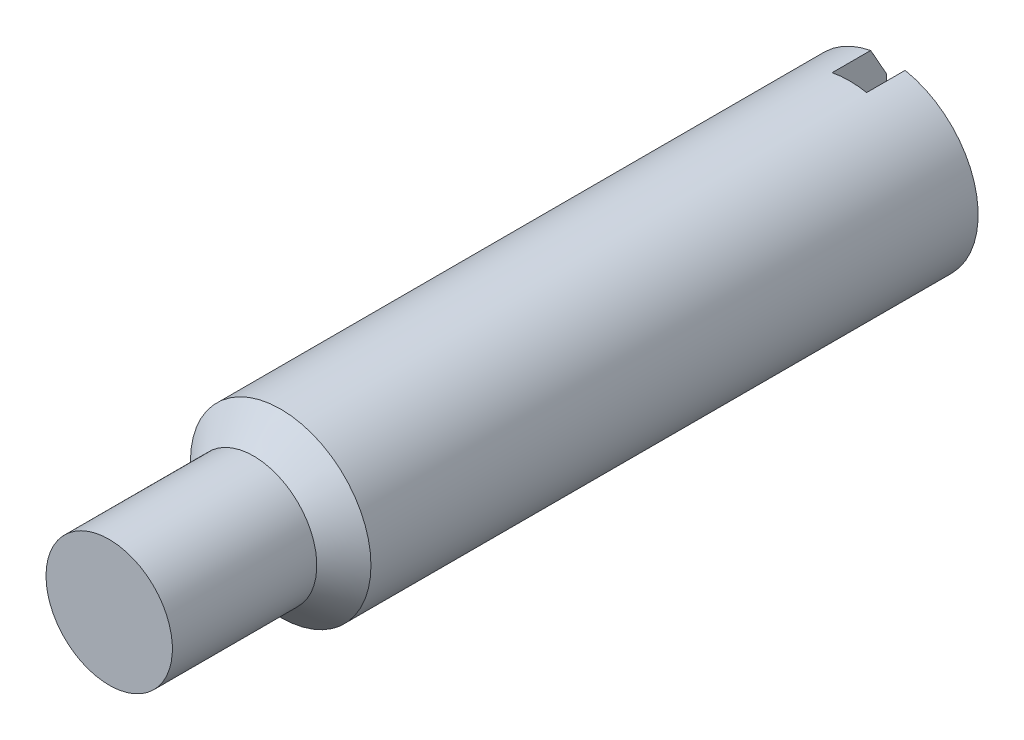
ISO-10303-21;
HEADER;
FILE_DESCRIPTION(('STEP AP214'),'2;1');
FILE_NAME('part.step','',(''),(''),'','','');
FILE_SCHEMA(('AUTOMOTIVE_DESIGN { 1 0 10303 214 1 1 1 1 }'));
ENDSEC;
DATA;
#1=APPLICATION_CONTEXT('core data for automotive mechanical design processes');
#2=APPLICATION_PROTOCOL_DEFINITION('international standard','automotive_design',2000,#1);
#3=PRODUCT_CONTEXT('',#1,'mechanical');
#4=PRODUCT('Part','Part','',(#3));
#5=PRODUCT_RELATED_PRODUCT_CATEGORY('part','',(#4));
#6=PRODUCT_DEFINITION_FORMATION('','',#4);
#7=PRODUCT_DEFINITION_CONTEXT('part definition',#1,'design');
#8=PRODUCT_DEFINITION('design','',#6,#7);
#9=PRODUCT_DEFINITION_SHAPE('','',#8);
#10=(LENGTH_UNIT() NAMED_UNIT(*) SI_UNIT(.MILLI.,.METRE.));
#11=(NAMED_UNIT(*) PLANE_ANGLE_UNIT() SI_UNIT($,.RADIAN.));
#12=(NAMED_UNIT(*) SI_UNIT($,.STERADIAN.) SOLID_ANGLE_UNIT());
#13=UNCERTAINTY_MEASURE_WITH_UNIT(LENGTH_MEASURE(1.E-05),#10,'distance_accuracy_value','');
#14=(GEOMETRIC_REPRESENTATION_CONTEXT(3) GLOBAL_UNCERTAINTY_ASSIGNED_CONTEXT((#13)) GLOBAL_UNIT_ASSIGNED_CONTEXT((#10,
#11,#12)) REPRESENTATION_CONTEXT('',''));
#15=CARTESIAN_POINT('',(0.,0.,0.));
#16=DIRECTION('',(0.,0.,1.));
#17=DIRECTION('',(1.,0.,0.));
#18=AXIS2_PLACEMENT_3D('',#15,#16,#17);
#19=CARTESIAN_POINT('',(0.,0.,0.));
#20=DIRECTION('',(0.,0.,-1.));
#21=DIRECTION('',(-1.,0.,0.));
#22=AXIS2_PLACEMENT_3D('',#19,#20,#21);
#23=PLANE('',#22);
#24=CARTESIAN_POINT('',(0.,0.,0.));
#25=DIRECTION('',(0.,0.,-1.));
#26=DIRECTION('',(-1.,0.,0.));
#27=AXIS2_PLACEMENT_3D('',#24,#25,#26);
#28=CIRCLE('',#27,3.5);
#29=CARTESIAN_POINT('',(0.954999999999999,3.36719096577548,0.));
#30=VERTEX_POINT('',#29);
#31=CARTESIAN_POINT('',(0.954999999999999,-3.36719096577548,0.));
#32=VERTEX_POINT('',#31);
#33=EDGE_CURVE('E164',#30,#32,#28,.T.);
#34=ORIENTED_EDGE('',*,*,#33,.T.);
#35=DIRECTION('',(0.,1.,0.));
#36=VECTOR('',#35,1.);
#37=CARTESIAN_POINT('',(0.954999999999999,-5.00000000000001,0.));
#38=LINE('',#37,#36);
#39=EDGE_CURVE('E105',#32,#30,#38,.T.);
#40=ORIENTED_EDGE('',*,*,#39,.T.);
#41=EDGE_LOOP('',(#34,#40));
#42=FACE_BOUND('',#41,.T.);
#43=ADVANCED_FACE('F33',(#42),#23,.T.);
#44=CARTESIAN_POINT('',(0.,0.,0.));
#45=DIRECTION('',(0.,0.,1.));
#46=DIRECTION('',(1.,0.,0.));
#47=AXIS2_PLACEMENT_3D('',#44,#45,#46);
#48=CONICAL_SURFACE('',#47,3.5,1.0471975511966);
#49=CARTESIAN_POINT('',(0.,0.,0.866025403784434));
#50=DIRECTION('',(0.,0.,-1.));
#51=DIRECTION('',(-1.,0.,0.));
#52=AXIS2_PLACEMENT_3D('',#49,#50,#51);
#53=CIRCLE('',#52,5.);
#54=CARTESIAN_POINT('',(0.955000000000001,4.90795018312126,0.866025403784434));
#55=VERTEX_POINT('',#54);
#56=CARTESIAN_POINT('',(0.955000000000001,-4.90795018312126,0.866025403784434));
#57=VERTEX_POINT('',#56);
#58=EDGE_CURVE('E169',#55,#57,#53,.T.);
#59=ORIENTED_EDGE('',*,*,#58,.T.);
#60=CARTESIAN_POINT('',(0.954999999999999,-11.0226579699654,4.36704919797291));
#61=CARTESIAN_POINT('',(0.954999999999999,-10.5566262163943,4.0990077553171));
#62=CARTESIAN_POINT('',(0.954999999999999,-10.0905538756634,3.83103660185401));
#63=CARTESIAN_POINT('',(0.954999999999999,-9.15823674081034,3.29538269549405));
#64=CARTESIAN_POINT('',(0.954999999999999,-8.69199194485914,3.02769994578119));
#65=CARTESIAN_POINT('',(0.954999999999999,-7.75819630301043,2.49217293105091));
#66=CARTESIAN_POINT('',(0.954999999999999,-7.29064488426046,2.22432966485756));
#67=CARTESIAN_POINT('',(0.954999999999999,-6.35511325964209,1.68940156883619));
#68=CARTESIAN_POINT('',(0.954999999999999,-5.88713305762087,1.42231673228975));
#69=CARTESIAN_POINT('',(0.954999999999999,-5.18597187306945,1.02365418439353));
#70=CARTESIAN_POINT('',(0.954999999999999,-4.9531155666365,0.891505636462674));
#71=CARTESIAN_POINT('',(0.954999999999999,-4.48707515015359,0.6277768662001));
#72=CARTESIAN_POINT('',(0.954999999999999,-4.25389103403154,0.496196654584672));
#73=CARTESIAN_POINT('',(0.954999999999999,-3.78731745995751,0.234113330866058));
#74=CARTESIAN_POINT('',(0.954999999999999,-3.55392866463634,0.103609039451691));
#75=CARTESIAN_POINT('',(0.954999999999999,-3.0863136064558,-0.155870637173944));
#76=CARTESIAN_POINT('',(0.955,-2.85208738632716,-0.284846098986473));
#77=CARTESIAN_POINT('',(0.955,-2.49827785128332,-0.476726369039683));
#78=CARTESIAN_POINT('',(0.955,-2.37930371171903,-0.54075173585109));
#79=CARTESIAN_POINT('',(0.955,-2.14071828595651,-0.667639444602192));
#80=CARTESIAN_POINT('',(0.955,-2.02110692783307,-0.730501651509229));
#81=CARTESIAN_POINT('',(0.955,-1.78055111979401,-0.85461803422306));
#82=CARTESIAN_POINT('',(0.955,-1.65960360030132,-0.915866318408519));
#83=CARTESIAN_POINT('',(0.955,-1.47704471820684,-1.00539757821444));
#84=CARTESIAN_POINT('',(0.955,-1.41600763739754,-1.03484862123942));
#85=CARTESIAN_POINT('',(0.955,-1.29343480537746,-1.09269118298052));
#86=CARTESIAN_POINT('',(0.955,-1.23189907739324,-1.12108275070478));
#87=CARTESIAN_POINT('',(0.955,-1.10456041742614,-1.17803952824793));
#88=CARTESIAN_POINT('',(0.955,-1.03871834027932,-1.2065178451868));
#89=CARTESIAN_POINT('',(0.955,-0.906084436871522,-1.26115325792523));
#90=CARTESIAN_POINT('',(0.955,-0.839292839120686,-1.28731090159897));
#91=CARTESIAN_POINT('',(0.955,-0.704788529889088,-1.33612743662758));
#92=CARTESIAN_POINT('',(0.955,-0.637081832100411,-1.35880263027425));
#93=CARTESIAN_POINT('',(0.955,-0.500197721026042,-1.39922872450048));
#94=CARTESIAN_POINT('',(0.955,-0.43102112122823,-1.41698227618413));
#95=CARTESIAN_POINT('',(0.955,-0.309028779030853,-1.44188890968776));
#96=CARTESIAN_POINT('',(0.955,-0.256535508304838,-1.45059038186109));
#97=CARTESIAN_POINT('',(0.955,-0.150986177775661,-1.46330161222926));
#98=CARTESIAN_POINT('',(0.955,-0.0979303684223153,-1.46731337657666));
#99=CARTESIAN_POINT('',(0.955,0.00823860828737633,-1.47018431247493));
#100=CARTESIAN_POINT('',(0.955,0.0613515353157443,-1.46905200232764));
#101=CARTESIAN_POINT('',(0.955,0.167227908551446,-1.46179215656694));
#102=CARTESIAN_POINT('',(0.955,0.219991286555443,-1.45566367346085));
#103=CARTESIAN_POINT('',(0.955,0.373341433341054,-1.43138271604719));
#104=CARTESIAN_POINT('',(0.955,0.472990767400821,-1.40735134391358));
#105=CARTESIAN_POINT('',(0.955,0.620133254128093,-1.36376240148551));
#106=CARTESIAN_POINT('',(0.955,0.668863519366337,-1.34794635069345));
#107=CARTESIAN_POINT('',(0.955,0.765657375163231,-1.31438139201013));
#108=CARTESIAN_POINT('',(0.955,0.813721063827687,-1.29663277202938));
#109=CARTESIAN_POINT('',(0.955,0.958560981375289,-1.24063690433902));
#110=CARTESIAN_POINT('',(0.955,1.05445298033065,-1.20012710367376));
#111=CARTESIAN_POINT('',(0.955,1.19703624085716,-1.13678966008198));
#112=CARTESIAN_POINT('',(0.955,1.24432403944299,-1.11526345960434));
#113=CARTESIAN_POINT('',(0.955,1.33857573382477,-1.07151224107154));
#114=CARTESIAN_POINT('',(0.955,1.3855396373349,-1.04928723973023));
#115=CARTESIAN_POINT('',(0.955,1.53812480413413,-0.975994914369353));
#116=CARTESIAN_POINT('',(0.955,1.6432111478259,-0.923817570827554));
#117=CARTESIAN_POINT('',(0.955,1.85252346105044,-0.817760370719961));
#118=CARTESIAN_POINT('',(0.955,1.95674936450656,-0.76388038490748));
#119=CARTESIAN_POINT('',(0.955,2.16463250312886,-0.654984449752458));
#120=CARTESIAN_POINT('',(0.955,2.26828961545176,-0.599968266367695));
#121=CARTESIAN_POINT('',(0.955,2.47518777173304,-0.489158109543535));
#122=CARTESIAN_POINT('',(0.955,2.57842881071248,-0.433364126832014));
#123=CARTESIAN_POINT('',(0.955,2.88790160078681,-0.265054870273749));
#124=CARTESIAN_POINT('',(0.954999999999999,3.09368549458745,-0.151717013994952));
#125=CARTESIAN_POINT('',(0.954999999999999,3.50455282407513,0.0761550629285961));
#126=CARTESIAN_POINT('',(0.954999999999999,3.70963634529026,0.190689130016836));
#127=CARTESIAN_POINT('',(0.954999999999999,4.11713122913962,0.419252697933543));
#128=CARTESIAN_POINT('',(0.954999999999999,4.31954722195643,0.533273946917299));
#129=CARTESIAN_POINT('',(0.954999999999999,4.72410937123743,0.761809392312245));
#130=CARTESIAN_POINT('',(0.954999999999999,4.92625551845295,0.876323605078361));
#131=CARTESIAN_POINT('',(0.954999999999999,5.53224106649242,1.22026991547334));
#132=CARTESIAN_POINT('',(0.954999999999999,5.93579707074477,1.45020115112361));
#133=CARTESIAN_POINT('',(0.954999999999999,6.72791655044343,1.90243763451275));
#134=CARTESIAN_POINT('',(0.954999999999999,7.1164943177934,2.12471788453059));
#135=CARTESIAN_POINT('',(0.954999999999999,7.89346888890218,2.56971590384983));
#136=CARTESIAN_POINT('',(0.954999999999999,8.28186566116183,2.79243372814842));
#137=CARTESIAN_POINT('',(0.954999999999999,9.06241703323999,3.24037601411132));
#138=CARTESIAN_POINT('',(0.954999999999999,9.45457010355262,3.46560313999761));
#139=CARTESIAN_POINT('',(0.954999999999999,10.2387123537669,3.91621762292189));
#140=CARTESIAN_POINT('',(0.954999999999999,10.6307015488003,4.14160495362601));
#141=CARTESIAN_POINT('',(0.954999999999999,11.0226579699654,4.3670491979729));
#142=B_SPLINE_CURVE_WITH_KNOTS('',3,(#60,#61,#62,#63,#64,#65,#66,#67,#68,#69,#70,#71,#72,#73,
#74,#75,#76,#77,#78,#79,#80,#81,#82,#83,#84,#85,#86,#87,#88,#89,#90,#91,#92,#93,#94,#95,#96,#97,
#98,#99,#100,#101,#102,#103,#104,#105,#106,#107,#108,#109,#110,#111,#112,#113,#114,#115,#116,
#117,#118,#119,#120,#121,#122,#123,#124,#125,#126,#127,#128,#129,#130,#131,#132,#133,#134,#135,
#136,#137,#138,#139,#140,#141),.UNSPECIFIED.,.F.,.F.,(4,2,2,2,2,2,2,2,2,2,2,2,2,2,2,2,2,2,2,2,2,
2,2,2,2,2,2,2,2,2,2,2,2,2,2,2,2,2,2,2,4),(0.,1.61285058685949,3.22571880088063,4.84222691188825,
6.45872065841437,7.26194354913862,8.06518151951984,8.8673736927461,9.66952550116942,
10.0748440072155,10.4802092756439,10.8868922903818,11.0901976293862,11.2934935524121,
11.5086750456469,11.7238056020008,11.9378961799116,12.1518712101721,12.3113246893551,
12.4707099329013,12.6298313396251,12.7889829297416,13.0954404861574,13.2491311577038,
13.4027989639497,13.7149501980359,13.8708199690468,14.0266860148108,14.3786380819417,
14.7306169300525,15.0826690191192,15.4347253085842,16.1395085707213,16.8442024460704,
17.5411644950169,18.2381498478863,19.6315369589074,20.9745225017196,22.317689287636,
23.6743769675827,25.0308778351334),.UNSPECIFIED.);
#143=EDGE_CURVE('E103',#57,#32,#142,.T.);
#144=ORIENTED_EDGE('',*,*,#143,.T.);
#145=ORIENTED_EDGE('',*,*,#33,.F.);
#146=EDGE_CURVE('E119',#30,#55,#142,.T.);
#147=ORIENTED_EDGE('',*,*,#146,.T.);
#148=EDGE_LOOP('',(#59,#144,#145,#147));
#149=FACE_BOUND('',#148,.T.);
#150=ADVANCED_FACE('F149',(#149),#48,.T.);
#151=CARTESIAN_POINT('',(0.,0.,-10.));
#152=DIRECTION('',(0.,0.,-1.));
#153=DIRECTION('',(-1.,0.,0.));
#154=AXIS2_PLACEMENT_3D('',#151,#152,#153);
#155=CYLINDRICAL_SURFACE('',#154,5.);
#156=CARTESIAN_POINT('',(0.,0.,34.5));
#157=DIRECTION('',(0.,0.,-1.));
#158=DIRECTION('',(-1.,0.,0.));
#159=AXIS2_PLACEMENT_3D('',#156,#157,#158);
#160=CIRCLE('',#159,5.00000000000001);
#161=CARTESIAN_POINT('',(-5.00000000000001,0.,34.5));
#162=VERTEX_POINT('',#161);
#163=EDGE_CURVE('E178',#162,#162,#160,.T.);
#164=ORIENTED_EDGE('',*,*,#163,.T.);
#165=EDGE_LOOP('',(#164));
#166=FACE_BOUND('',#165,.T.);
#167=CARTESIAN_POINT('',(0.,0.,3.));
#168=DIRECTION('',(0.,0.,1.));
#169=DIRECTION('',(1.,0.,0.));
#170=AXIS2_PLACEMENT_3D('',#167,#168,#169);
#171=CIRCLE('',#170,5.);
#172=CARTESIAN_POINT('',(0.954999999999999,-4.90795018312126,3.));
#173=VERTEX_POINT('',#172);
#174=CARTESIAN_POINT('',(-0.955000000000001,-4.90795018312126,3.));
#175=VERTEX_POINT('',#174);
#176=EDGE_CURVE('E85',#173,#175,#171,.F.);
#177=ORIENTED_EDGE('',*,*,#176,.F.);
#178=DIRECTION('',(0.,0.,-1.));
#179=VECTOR('',#178,1.);
#180=CARTESIAN_POINT('',(0.955000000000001,-4.90795018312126,-10.));
#181=LINE('',#180,#179);
#182=EDGE_CURVE('E11',#173,#57,#181,.T.);
#183=ORIENTED_EDGE('',*,*,#182,.T.);
#184=ORIENTED_EDGE('',*,*,#58,.F.);
#185=DIRECTION('',(0.,0.,-1.));
#186=VECTOR('',#185,1.);
#187=CARTESIAN_POINT('',(0.955000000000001,4.90795018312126,-10.));
#188=LINE('',#187,#186);
#189=CARTESIAN_POINT('',(0.954999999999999,4.90795018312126,3.));
#190=VERTEX_POINT('',#189);
#191=EDGE_CURVE('E94',#55,#190,#188,.F.);
#192=ORIENTED_EDGE('',*,*,#191,.T.);
#193=CARTESIAN_POINT('',(-0.955000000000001,4.90795018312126,3.));
#194=VERTEX_POINT('',#193);
#195=EDGE_CURVE('E96',#194,#190,#171,.F.);
#196=ORIENTED_EDGE('',*,*,#195,.F.);
#197=DIRECTION('',(0.,0.,-1.));
#198=VECTOR('',#197,1.);
#199=CARTESIAN_POINT('',(-0.955,4.90795018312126,-10.));
#200=LINE('',#199,#198);
#201=CARTESIAN_POINT('',(-0.955,4.90795018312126,0.866025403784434));
#202=VERTEX_POINT('',#201);
#203=EDGE_CURVE('E41',#202,#194,#200,.F.);
#204=ORIENTED_EDGE('',*,*,#203,.F.);
#205=CARTESIAN_POINT('',(-0.955,-4.90795018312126,0.866025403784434));
#206=VERTEX_POINT('',#205);
#207=EDGE_CURVE('E171',#206,#202,#53,.T.);
#208=ORIENTED_EDGE('',*,*,#207,.F.);
#209=DIRECTION('',(0.,0.,-1.));
#210=VECTOR('',#209,1.);
#211=CARTESIAN_POINT('',(-0.955,-4.90795018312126,-10.));
#212=LINE('',#211,#210);
#213=EDGE_CURVE('E55',#175,#206,#212,.T.);
#214=ORIENTED_EDGE('',*,*,#213,.F.);
#215=EDGE_LOOP('',(#177,#183,#184,#192,#196,#204,#208,#214));
#216=FACE_BOUND('',#215,.T.);
#217=ADVANCED_FACE('F87',(#166,#216),#155,.T.);
#218=DIRECTION('',(0.,1.,0.));
#219=VECTOR('',#218,1.);
#220=CARTESIAN_POINT('',(-0.955,-5.00000000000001,0.));
#221=LINE('',#220,#219);
#222=CARTESIAN_POINT('',(-0.955,-3.36719096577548,0.));
#223=VERTEX_POINT('',#222);
#224=CARTESIAN_POINT('',(-0.955,3.36719096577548,0.));
#225=VERTEX_POINT('',#224);
#226=EDGE_CURVE('E109',#223,#225,#221,.T.);
#227=ORIENTED_EDGE('',*,*,#226,.F.);
#228=EDGE_CURVE('E166',#223,#225,#28,.T.);
#229=ORIENTED_EDGE('',*,*,#228,.T.);
#230=EDGE_LOOP('',(#227,#229));
#231=FACE_BOUND('',#230,.T.);
#232=ADVANCED_FACE('F35',(#231),#23,.T.);
#233=CARTESIAN_POINT('',(-0.955000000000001,-11.0226579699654,4.36704919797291));
#234=CARTESIAN_POINT('',(-0.955000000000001,-10.5566262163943,4.0990077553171));
#235=CARTESIAN_POINT('',(-0.955000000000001,-10.0905538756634,3.83103660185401));
#236=CARTESIAN_POINT('',(-0.955000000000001,-9.15823674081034,3.29538269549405));
#237=CARTESIAN_POINT('',(-0.955000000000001,-8.69199194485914,3.02769994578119));
#238=CARTESIAN_POINT('',(-0.955000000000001,-7.75819630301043,2.49217293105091));
#239=CARTESIAN_POINT('',(-0.955000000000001,-7.29064488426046,2.22432966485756));
#240=CARTESIAN_POINT('',(-0.955000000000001,-6.35511325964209,1.68940156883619));
#241=CARTESIAN_POINT('',(-0.955000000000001,-5.88713305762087,1.42231673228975));
#242=CARTESIAN_POINT('',(-0.955000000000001,-5.18597187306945,1.02365418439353));
#243=CARTESIAN_POINT('',(-0.955000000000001,-4.9531155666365,0.891505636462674));
#244=CARTESIAN_POINT('',(-0.955000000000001,-4.48707515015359,0.627776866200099));
#245=CARTESIAN_POINT('',(-0.955,-4.25389103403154,0.496196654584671));
#246=CARTESIAN_POINT('',(-0.955,-3.78731745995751,0.234113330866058));
#247=CARTESIAN_POINT('',(-0.955,-3.55392866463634,0.103609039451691));
#248=CARTESIAN_POINT('',(-0.955,-3.0863136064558,-0.155870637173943));
#249=CARTESIAN_POINT('',(-0.955,-2.85208738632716,-0.284846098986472));
#250=CARTESIAN_POINT('',(-0.955,-2.49827785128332,-0.476726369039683));
#251=CARTESIAN_POINT('',(-0.955,-2.37930371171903,-0.540751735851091));
#252=CARTESIAN_POINT('',(-0.955,-2.14071828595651,-0.667639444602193));
#253=CARTESIAN_POINT('',(-0.955,-2.02110692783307,-0.730501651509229));
#254=CARTESIAN_POINT('',(-0.955,-1.78055111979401,-0.85461803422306));
#255=CARTESIAN_POINT('',(-0.955,-1.65960360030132,-0.915866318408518));
#256=CARTESIAN_POINT('',(-0.955,-1.47704471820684,-1.00539757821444));
#257=CARTESIAN_POINT('',(-0.955,-1.41600763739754,-1.03484862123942));
#258=CARTESIAN_POINT('',(-0.955,-1.29343480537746,-1.09269118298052));
#259=CARTESIAN_POINT('',(-0.955,-1.23189907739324,-1.12108275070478));
#260=CARTESIAN_POINT('',(-0.955,-1.10456041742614,-1.17803952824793));
#261=CARTESIAN_POINT('',(-0.955,-1.03871834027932,-1.2065178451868));
#262=CARTESIAN_POINT('',(-0.955,-0.906084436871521,-1.26115325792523));
#263=CARTESIAN_POINT('',(-0.955,-0.839292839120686,-1.28731090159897));
#264=CARTESIAN_POINT('',(-0.955,-0.704788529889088,-1.33612743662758));
#265=CARTESIAN_POINT('',(-0.955,-0.63708183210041,-1.35880263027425));
#266=CARTESIAN_POINT('',(-0.955,-0.500197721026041,-1.39922872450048));
#267=CARTESIAN_POINT('',(-0.955,-0.431021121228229,-1.41698227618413));
#268=CARTESIAN_POINT('',(-0.955,-0.309028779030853,-1.44188890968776));
#269=CARTESIAN_POINT('',(-0.955,-0.256535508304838,-1.45059038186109));
#270=CARTESIAN_POINT('',(-0.955,-0.150986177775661,-1.46330161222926));
#271=CARTESIAN_POINT('',(-0.955,-0.0979303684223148,-1.46731337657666));
#272=CARTESIAN_POINT('',(-0.955,0.00823860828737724,-1.47018431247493));
#273=CARTESIAN_POINT('',(-0.955,0.0613515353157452,-1.46905200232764));
#274=CARTESIAN_POINT('',(-0.955,0.167227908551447,-1.46179215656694));
#275=CARTESIAN_POINT('',(-0.955,0.219991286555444,-1.45566367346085));
#276=CARTESIAN_POINT('',(-0.955,0.373341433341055,-1.43138271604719));
#277=CARTESIAN_POINT('',(-0.955,0.472990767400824,-1.40735134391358));
#278=CARTESIAN_POINT('',(-0.955,0.620133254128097,-1.3637624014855));
#279=CARTESIAN_POINT('',(-0.955,0.668863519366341,-1.34794635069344));
#280=CARTESIAN_POINT('',(-0.955,0.765657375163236,-1.31438139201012));
#281=CARTESIAN_POINT('',(-0.955,0.813721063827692,-1.29663277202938));
#282=CARTESIAN_POINT('',(-0.955,0.958560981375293,-1.24063690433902));
#283=CARTESIAN_POINT('',(-0.955,1.05445298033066,-1.20012710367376));
#284=CARTESIAN_POINT('',(-0.955,1.19703624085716,-1.13678966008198));
#285=CARTESIAN_POINT('',(-0.955,1.24432403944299,-1.11526345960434));
#286=CARTESIAN_POINT('',(-0.955,1.33857573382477,-1.07151224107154));
#287=CARTESIAN_POINT('',(-0.955,1.3855396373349,-1.04928723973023));
#288=CARTESIAN_POINT('',(-0.955,1.53812480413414,-0.97599491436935));
#289=CARTESIAN_POINT('',(-0.955,1.64321114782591,-0.923817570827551));
#290=CARTESIAN_POINT('',(-0.955,1.85252346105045,-0.817760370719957));
#291=CARTESIAN_POINT('',(-0.955,1.95674936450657,-0.763880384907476));
#292=CARTESIAN_POINT('',(-0.955,2.16463250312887,-0.654984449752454));
#293=CARTESIAN_POINT('',(-0.955,2.26828961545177,-0.599968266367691));
#294=CARTESIAN_POINT('',(-0.955,2.47518777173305,-0.48915810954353));
#295=CARTESIAN_POINT('',(-0.955,2.57842881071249,-0.433364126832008));
#296=CARTESIAN_POINT('',(-0.955,2.88790160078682,-0.265054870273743));
#297=CARTESIAN_POINT('',(-0.955,3.09368549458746,-0.151717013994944));
#298=CARTESIAN_POINT('',(-0.955,3.50455282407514,0.0761550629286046));
#299=CARTESIAN_POINT('',(-0.955,3.70963634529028,0.190689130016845));
#300=CARTESIAN_POINT('',(-0.955,4.11713122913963,0.419252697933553));
#301=CARTESIAN_POINT('',(-0.955,4.31954722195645,0.53327394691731));
#302=CARTESIAN_POINT('',(-0.955,4.72410937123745,0.761809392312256));
#303=CARTESIAN_POINT('',(-0.955000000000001,4.92625551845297,0.876323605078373));
#304=CARTESIAN_POINT('',(-0.955000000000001,5.53224106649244,1.22026991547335));
#305=CARTESIAN_POINT('',(-0.955000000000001,5.93579707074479,1.45020115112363));
#306=CARTESIAN_POINT('',(-0.955000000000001,6.72791655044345,1.90243763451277));
#307=CARTESIAN_POINT('',(-0.955000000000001,7.11649431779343,2.1247178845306));
#308=CARTESIAN_POINT('',(-0.955000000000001,7.8934688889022,2.56971590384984));
#309=CARTESIAN_POINT('',(-0.955000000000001,8.28186566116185,2.79243372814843));
#310=CARTESIAN_POINT('',(-0.955000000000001,9.06241703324,3.24037601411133));
#311=CARTESIAN_POINT('',(-0.955000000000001,9.45457010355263,3.46560313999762));
#312=CARTESIAN_POINT('',(-0.955000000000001,10.2387123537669,3.91621762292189));
#313=CARTESIAN_POINT('',(-0.955000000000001,10.6307015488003,4.14160495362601));
#314=CARTESIAN_POINT('',(-0.955000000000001,11.0226579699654,4.3670491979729));
#315=B_SPLINE_CURVE_WITH_KNOTS('',3,(#233,#234,#235,#236,#237,#238,#239,#240,#241,#242,#243,
#244,#245,#246,#247,#248,#249,#250,#251,#252,#253,#254,#255,#256,#257,#258,#259,#260,#261,#262,
#263,#264,#265,#266,#267,#268,#269,#270,#271,#272,#273,#274,#275,#276,#277,#278,#279,#280,#281,
#282,#283,#284,#285,#286,#287,#288,#289,#290,#291,#292,#293,#294,#295,#296,#297,#298,#299,#300,
#301,#302,#303,#304,#305,#306,#307,#308,#309,#310,#311,#312,#313,#314),.UNSPECIFIED.,.F.,.F.,(4,
2,2,2,2,2,2,2,2,2,2,2,2,2,2,2,2,2,2,2,2,2,2,2,2,2,2,2,2,2,2,2,2,2,2,2,2,2,2,2,4),(0.,
1.61285058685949,3.22571880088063,4.84222691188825,6.45872065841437,7.26194354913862,
8.06518151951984,8.86737369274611,9.66952550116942,10.0748440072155,10.4802092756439,
10.8868922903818,11.0901976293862,11.2934935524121,11.5086750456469,11.7238056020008,
11.9378961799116,12.1518712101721,12.3113246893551,12.4707099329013,12.6298313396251,
12.7889829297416,13.0954404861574,13.2491311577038,13.4027989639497,13.7149501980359,
13.8708199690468,14.0266860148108,14.3786380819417,14.7306169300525,15.0826690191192,
15.4347253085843,16.1395085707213,16.8442024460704,17.5411644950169,18.2381498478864,
19.6315369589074,20.9745225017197,22.317689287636,23.6743769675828,25.0308778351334),.UNSPECIFIED.);
#316=EDGE_CURVE('E120',#206,#223,#315,.T.);
#317=ORIENTED_EDGE('',*,*,#316,.F.);
#318=ORIENTED_EDGE('',*,*,#207,.T.);
#319=EDGE_CURVE('E48',#225,#202,#315,.T.);
#320=ORIENTED_EDGE('',*,*,#319,.F.);
#321=ORIENTED_EDGE('',*,*,#228,.F.);
#322=EDGE_LOOP('',(#317,#318,#320,#321));
#323=FACE_BOUND('',#322,.T.);
#324=ADVANCED_FACE('F126',(#323),#48,.T.);
#325=CARTESIAN_POINT('',(0.,0.,36.));
#326=DIRECTION('',(0.,0.,-1.));
#327=DIRECTION('',(-1.,0.,0.));
#328=AXIS2_PLACEMENT_3D('',#325,#326,#327);
#329=CONICAL_SURFACE('',#328,3.50000000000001,0.785398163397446);
#330=ORIENTED_EDGE('',*,*,#163,.F.);
#331=EDGE_LOOP('',(#330));
#332=FACE_BOUND('',#331,.T.);
#333=CARTESIAN_POINT('',(0.,0.,36.));
#334=DIRECTION('',(0.,0.,-1.));
#335=DIRECTION('',(-1.,0.,0.));
#336=AXIS2_PLACEMENT_3D('',#333,#334,#335);
#337=CIRCLE('',#336,3.50000000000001);
#338=CARTESIAN_POINT('',(-3.50000000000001,0.,36.));
#339=VERTEX_POINT('',#338);
#340=EDGE_CURVE('E179',#339,#339,#337,.T.);
#341=ORIENTED_EDGE('',*,*,#340,.T.);
#342=EDGE_LOOP('',(#341));
#343=FACE_BOUND('',#342,.T.);
#344=ADVANCED_FACE('F144',(#332,#343),#329,.T.);
#345=CARTESIAN_POINT('',(0.,0.,-10.));
#346=DIRECTION('',(0.,0.,-1.));
#347=DIRECTION('',(-1.,0.,0.));
#348=AXIS2_PLACEMENT_3D('',#345,#346,#347);
#349=CYLINDRICAL_SURFACE('',#348,3.50000000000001);
#350=CARTESIAN_POINT('',(0.,0.,44.));
#351=DIRECTION('',(0.,0.,-1.));
#352=DIRECTION('',(-1.,0.,0.));
#353=AXIS2_PLACEMENT_3D('',#350,#351,#352);
#354=CIRCLE('',#353,3.50000000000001);
#355=CARTESIAN_POINT('',(-3.50000000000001,0.,44.));
#356=VERTEX_POINT('',#355);
#357=EDGE_CURVE('E182',#356,#356,#354,.T.);
#358=ORIENTED_EDGE('',*,*,#357,.T.);
#359=EDGE_LOOP('',(#358));
#360=FACE_BOUND('',#359,.T.);
#361=ORIENTED_EDGE('',*,*,#340,.F.);
#362=EDGE_LOOP('',(#361));
#363=FACE_BOUND('',#362,.T.);
#364=ADVANCED_FACE('F140',(#360,#363),#349,.T.);
#365=CARTESIAN_POINT('',(3.50000000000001,0.,44.));
#366=DIRECTION('',(0.,0.,1.));
#367=DIRECTION('',(1.,0.,0.));
#368=AXIS2_PLACEMENT_3D('',#365,#366,#367);
#369=PLANE('',#368);
#370=ORIENTED_EDGE('',*,*,#357,.F.);
#371=EDGE_LOOP('',(#370));
#372=FACE_BOUND('',#371,.T.);
#373=ADVANCED_FACE('F137',(#372),#369,.T.);
#374=CARTESIAN_POINT('',(-0.955,-5.00000000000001,0.));
#375=DIRECTION('',(-1.,0.,0.));
#376=DIRECTION('',(0.,0.,1.));
#377=AXIS2_PLACEMENT_3D('',#374,#375,#376);
#378=PLANE('',#377);
#379=ORIENTED_EDGE('',*,*,#319,.T.);
#380=ORIENTED_EDGE('',*,*,#203,.T.);
#381=DIRECTION('',(0.,1.,0.));
#382=VECTOR('',#381,1.);
#383=CARTESIAN_POINT('',(-0.955000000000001,-5.00000000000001,3.));
#384=LINE('',#383,#382);
#385=EDGE_CURVE('E106',#175,#194,#384,.T.);
#386=ORIENTED_EDGE('',*,*,#385,.F.);
#387=ORIENTED_EDGE('',*,*,#213,.T.);
#388=ORIENTED_EDGE('',*,*,#316,.T.);
#389=ORIENTED_EDGE('',*,*,#226,.T.);
#390=EDGE_LOOP('',(#379,#380,#386,#387,#388,#389));
#391=FACE_BOUND('',#390,.T.);
#392=ADVANCED_FACE('F132',(#391),#378,.F.);
#393=CARTESIAN_POINT('',(0.954999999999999,-5.00000000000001,0.));
#394=DIRECTION('',(-1.,0.,0.));
#395=DIRECTION('',(0.,0.,1.));
#396=AXIS2_PLACEMENT_3D('',#393,#394,#395);
#397=PLANE('',#396);
#398=ORIENTED_EDGE('',*,*,#39,.F.);
#399=ORIENTED_EDGE('',*,*,#143,.F.);
#400=ORIENTED_EDGE('',*,*,#182,.F.);
#401=DIRECTION('',(0.,1.,0.));
#402=VECTOR('',#401,1.);
#403=CARTESIAN_POINT('',(0.954999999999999,-5.00000000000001,3.));
#404=LINE('',#403,#402);
#405=EDGE_CURVE('E100',#173,#190,#404,.T.);
#406=ORIENTED_EDGE('',*,*,#405,.T.);
#407=ORIENTED_EDGE('',*,*,#191,.F.);
#408=ORIENTED_EDGE('',*,*,#146,.F.);
#409=EDGE_LOOP('',(#398,#399,#400,#406,#407,#408));
#410=FACE_BOUND('',#409,.T.);
#411=ADVANCED_FACE('F99',(#410),#397,.T.);
#412=CARTESIAN_POINT('',(-0.955000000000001,-5.00000000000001,3.));
#413=DIRECTION('',(0.,0.,1.));
#414=DIRECTION('',(1.,0.,0.));
#415=AXIS2_PLACEMENT_3D('',#412,#413,#414);
#416=PLANE('',#415);
#417=ORIENTED_EDGE('',*,*,#405,.F.);
#418=ORIENTED_EDGE('',*,*,#176,.T.);
#419=ORIENTED_EDGE('',*,*,#385,.T.);
#420=ORIENTED_EDGE('',*,*,#195,.T.);
#421=EDGE_LOOP('',(#417,#418,#419,#420));
#422=FACE_BOUND('',#421,.T.);
#423=ADVANCED_FACE('F104',(#422),#416,.F.);
#424=CLOSED_SHELL('',(#43,#150,#217,#232,#324,#344,#364,#373,#392,#411,#423));
#425=MANIFOLD_SOLID_BREP('B2',#424);
#426=ADVANCED_BREP_SHAPE_REPRESENTATION('',(#18,#425),#14);
#427=SHAPE_DEFINITION_REPRESENTATION(#9,#426);
ENDSEC;
END-ISO-10303-21;
